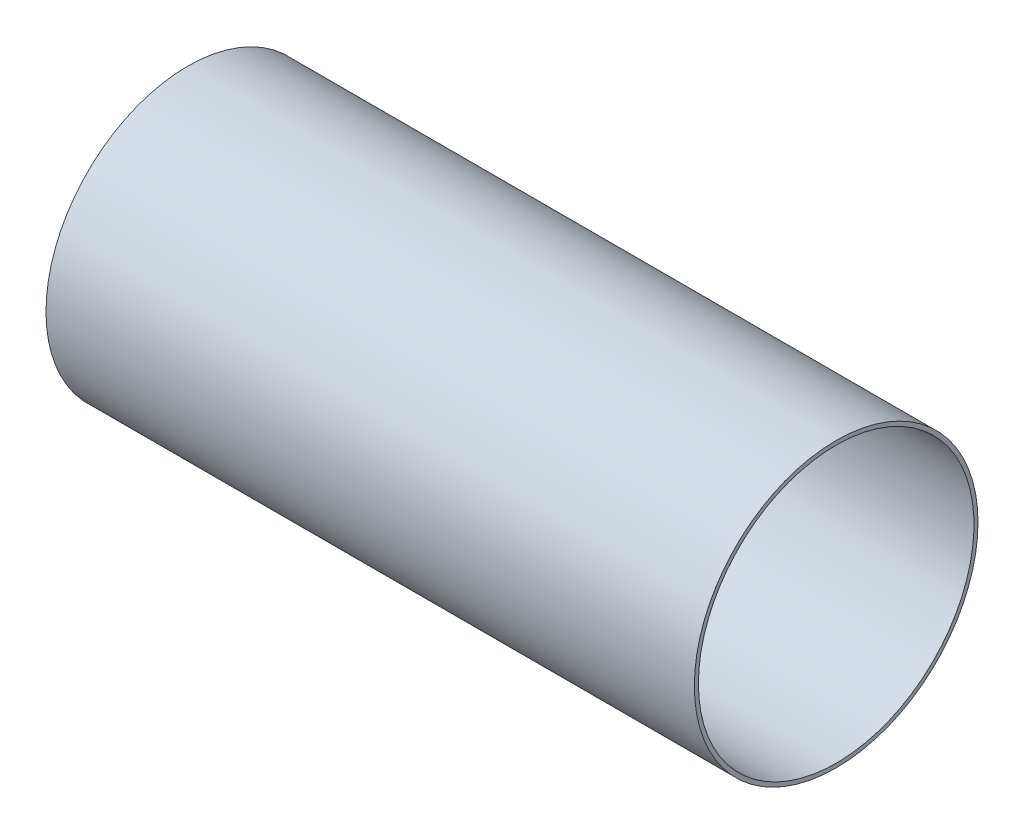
ISO-10303-21;
HEADER;
FILE_DESCRIPTION(('STEP AP214'),'2;1');
FILE_NAME('part.step','',(''),(''),'','','');
FILE_SCHEMA(('AUTOMOTIVE_DESIGN { 1 0 10303 214 1 1 1 1 }'));
ENDSEC;
DATA;
#1=APPLICATION_CONTEXT('core data for automotive mechanical design processes');
#2=APPLICATION_PROTOCOL_DEFINITION('international standard','automotive_design',2000,#1);
#3=PRODUCT_CONTEXT('',#1,'mechanical');
#4=PRODUCT('Part','Part','',(#3));
#5=PRODUCT_RELATED_PRODUCT_CATEGORY('part','',(#4));
#6=PRODUCT_DEFINITION_FORMATION('','',#4);
#7=PRODUCT_DEFINITION_CONTEXT('part definition',#1,'design');
#8=PRODUCT_DEFINITION('design','',#6,#7);
#9=PRODUCT_DEFINITION_SHAPE('','',#8);
#10=(LENGTH_UNIT() NAMED_UNIT(*) SI_UNIT(.MILLI.,.METRE.));
#11=(NAMED_UNIT(*) PLANE_ANGLE_UNIT() SI_UNIT($,.RADIAN.));
#12=(NAMED_UNIT(*) SI_UNIT($,.STERADIAN.) SOLID_ANGLE_UNIT());
#13=UNCERTAINTY_MEASURE_WITH_UNIT(LENGTH_MEASURE(1.E-05),#10,'distance_accuracy_value','');
#14=(GEOMETRIC_REPRESENTATION_CONTEXT(3) GLOBAL_UNCERTAINTY_ASSIGNED_CONTEXT((#13)) GLOBAL_UNIT_ASSIGNED_CONTEXT((#10,
#11,#12)) REPRESENTATION_CONTEXT('',''));
#15=CARTESIAN_POINT('',(0.,0.,0.));
#16=DIRECTION('',(0.,0.,1.));
#17=DIRECTION('',(1.,0.,0.));
#18=AXIS2_PLACEMENT_3D('',#15,#16,#17);
#19=CARTESIAN_POINT('',(0.,0.,0.));
#20=DIRECTION('',(-1.,0.,0.));
#21=DIRECTION('',(0.,0.,1.));
#22=AXIS2_PLACEMENT_3D('',#19,#20,#21);
#23=CYLINDRICAL_SURFACE('',#22,0.8);
#24=CARTESIAN_POINT('',(0.8,0.,0.));
#25=DIRECTION('',(-1.,0.,0.));
#26=DIRECTION('',(0.,0.,1.));
#27=AXIS2_PLACEMENT_3D('',#24,#25,#26);
#28=CIRCLE('',#27,0.8);
#29=CARTESIAN_POINT('',(0.8,0.,0.8));
#30=VERTEX_POINT('',#29);
#31=EDGE_CURVE('E57',#30,#30,#28,.T.);
#32=ORIENTED_EDGE('',*,*,#31,.F.);
#33=EDGE_LOOP('',(#32));
#34=FACE_BOUND('',#33,.T.);
#35=CARTESIAN_POINT('',(0.,0.,0.));
#36=DIRECTION('',(-1.,0.,0.));
#37=DIRECTION('',(0.,0.,1.));
#38=AXIS2_PLACEMENT_3D('',#35,#36,#37);
#39=CIRCLE('',#38,0.8);
#40=CARTESIAN_POINT('',(0.,0.,0.8));
#41=VERTEX_POINT('',#40);
#42=EDGE_CURVE('E10',#41,#41,#39,.T.);
#43=ORIENTED_EDGE('',*,*,#42,.T.);
#44=EDGE_LOOP('',(#43));
#45=FACE_BOUND('',#44,.T.);
#46=ADVANCED_FACE('F29',(#34,#45),#23,.F.);
#47=CARTESIAN_POINT('',(0.,3.5,0.));
#48=DIRECTION('',(1.,0.,0.));
#49=DIRECTION('',(0.,0.,-1.));
#50=AXIS2_PLACEMENT_3D('',#47,#48,#49);
#51=PLANE('',#50);
#52=ORIENTED_EDGE('',*,*,#42,.F.);
#53=EDGE_LOOP('',(#52));
#54=FACE_BOUND('',#53,.T.);
#55=CARTESIAN_POINT('',(0.,0.,0.));
#56=DIRECTION('',(-1.,0.,0.));
#57=DIRECTION('',(0.,0.,1.));
#58=AXIS2_PLACEMENT_3D('',#55,#56,#57);
#59=CIRCLE('',#58,3.5);
#60=CARTESIAN_POINT('',(0.,0.,3.5));
#61=VERTEX_POINT('',#60);
#62=EDGE_CURVE('E35',#61,#61,#59,.T.);
#63=ORIENTED_EDGE('',*,*,#62,.T.);
#64=EDGE_LOOP('',(#63));
#65=FACE_BOUND('',#64,.T.);
#66=ADVANCED_FACE('F65',(#54,#65),#51,.F.);
#67=CARTESIAN_POINT('',(0.,0.,0.));
#68=DIRECTION('',(-1.,0.,0.));
#69=DIRECTION('',(0.,0.,1.));
#70=AXIS2_PLACEMENT_3D('',#67,#68,#69);
#71=CYLINDRICAL_SURFACE('',#70,3.5);
#72=ORIENTED_EDGE('',*,*,#62,.F.);
#73=EDGE_LOOP('',(#72));
#74=FACE_BOUND('',#73,.T.);
#75=CARTESIAN_POINT('',(16.,0.,0.));
#76=DIRECTION('',(-1.,0.,0.));
#77=DIRECTION('',(0.,0.,1.));
#78=AXIS2_PLACEMENT_3D('',#75,#76,#77);
#79=CIRCLE('',#78,3.5);
#80=CARTESIAN_POINT('',(16.,0.,3.5));
#81=VERTEX_POINT('',#80);
#82=EDGE_CURVE('E39',#81,#81,#79,.T.);
#83=ORIENTED_EDGE('',*,*,#82,.T.);
#84=EDGE_LOOP('',(#83));
#85=FACE_BOUND('',#84,.T.);
#86=ADVANCED_FACE('F69',(#74,#85),#71,.T.);
#87=CARTESIAN_POINT('',(16.,3.5,0.));
#88=DIRECTION('',(1.,0.,0.));
#89=DIRECTION('',(0.,0.,-1.));
#90=AXIS2_PLACEMENT_3D('',#87,#88,#89);
#91=PLANE('',#90);
#92=CARTESIAN_POINT('',(16.,0.,0.));
#93=DIRECTION('',(-1.,0.,0.));
#94=DIRECTION('',(0.,0.,1.));
#95=AXIS2_PLACEMENT_3D('',#92,#93,#94);
#96=CIRCLE('',#95,3.4);
#97=CARTESIAN_POINT('',(16.,0.,3.4));
#98=VERTEX_POINT('',#97);
#99=EDGE_CURVE('E43',#98,#98,#96,.T.);
#100=ORIENTED_EDGE('',*,*,#99,.T.);
#101=EDGE_LOOP('',(#100));
#102=FACE_BOUND('',#101,.T.);
#103=ORIENTED_EDGE('',*,*,#82,.F.);
#104=EDGE_LOOP('',(#103));
#105=FACE_BOUND('',#104,.T.);
#106=ADVANCED_FACE('F74',(#102,#105),#91,.T.);
#107=CARTESIAN_POINT('',(0.,0.,0.));
#108=DIRECTION('',(-1.,0.,0.));
#109=DIRECTION('',(0.,0.,1.));
#110=AXIS2_PLACEMENT_3D('',#107,#108,#109);
#111=CYLINDRICAL_SURFACE('',#110,3.4);
#112=CARTESIAN_POINT('',(0.100000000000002,0.,0.));
#113=DIRECTION('',(-1.,0.,0.));
#114=DIRECTION('',(0.,0.,1.));
#115=AXIS2_PLACEMENT_3D('',#112,#113,#114);
#116=CIRCLE('',#115,3.4);
#117=CARTESIAN_POINT('',(0.100000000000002,0.,3.4));
#118=VERTEX_POINT('',#117);
#119=EDGE_CURVE('E48',#118,#118,#116,.T.);
#120=ORIENTED_EDGE('',*,*,#119,.T.);
#121=EDGE_LOOP('',(#120));
#122=FACE_BOUND('',#121,.T.);
#123=ORIENTED_EDGE('',*,*,#99,.F.);
#124=EDGE_LOOP('',(#123));
#125=FACE_BOUND('',#124,.T.);
#126=ADVANCED_FACE('F80',(#122,#125),#111,.F.);
#127=CARTESIAN_POINT('',(0.100000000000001,3.5,0.));
#128=DIRECTION('',(1.,0.,0.));
#129=DIRECTION('',(0.,0.,-1.));
#130=AXIS2_PLACEMENT_3D('',#127,#128,#129);
#131=PLANE('',#130);
#132=CARTESIAN_POINT('',(0.1,0.,0.));
#133=DIRECTION('',(-1.,0.,0.));
#134=DIRECTION('',(0.,0.,1.));
#135=AXIS2_PLACEMENT_3D('',#132,#133,#134);
#136=CIRCLE('',#135,0.9);
#137=CARTESIAN_POINT('',(0.1,0.,0.9));
#138=VERTEX_POINT('',#137);
#139=EDGE_CURVE('E51',#138,#138,#136,.T.);
#140=ORIENTED_EDGE('',*,*,#139,.T.);
#141=EDGE_LOOP('',(#140));
#142=FACE_BOUND('',#141,.T.);
#143=ORIENTED_EDGE('',*,*,#119,.F.);
#144=EDGE_LOOP('',(#143));
#145=FACE_BOUND('',#144,.T.);
#146=ADVANCED_FACE('F84',(#142,#145),#131,.T.);
#147=CARTESIAN_POINT('',(0.,0.,0.));
#148=DIRECTION('',(-1.,0.,0.));
#149=DIRECTION('',(0.,0.,1.));
#150=AXIS2_PLACEMENT_3D('',#147,#148,#149);
#151=CYLINDRICAL_SURFACE('',#150,0.9);
#152=CARTESIAN_POINT('',(0.8,0.,0.));
#153=DIRECTION('',(-1.,0.,0.));
#154=DIRECTION('',(0.,0.,1.));
#155=AXIS2_PLACEMENT_3D('',#152,#153,#154);
#156=CIRCLE('',#155,0.9);
#157=CARTESIAN_POINT('',(0.8,0.,0.9));
#158=VERTEX_POINT('',#157);
#159=EDGE_CURVE('E54',#158,#158,#156,.T.);
#160=ORIENTED_EDGE('',*,*,#159,.T.);
#161=EDGE_LOOP('',(#160));
#162=FACE_BOUND('',#161,.T.);
#163=ORIENTED_EDGE('',*,*,#139,.F.);
#164=EDGE_LOOP('',(#163));
#165=FACE_BOUND('',#164,.T.);
#166=ADVANCED_FACE('F88',(#162,#165),#151,.T.);
#167=CARTESIAN_POINT('',(0.8,0.9,0.));
#168=DIRECTION('',(1.,0.,0.));
#169=DIRECTION('',(0.,0.,-1.));
#170=AXIS2_PLACEMENT_3D('',#167,#168,#169);
#171=PLANE('',#170);
#172=ORIENTED_EDGE('',*,*,#31,.T.);
#173=EDGE_LOOP('',(#172));
#174=FACE_BOUND('',#173,.T.);
#175=ORIENTED_EDGE('',*,*,#159,.F.);
#176=EDGE_LOOP('',(#175));
#177=FACE_BOUND('',#176,.T.);
#178=ADVANCED_FACE('F61',(#174,#177),#171,.T.);
#179=CLOSED_SHELL('',(#46,#66,#86,#106,#126,#146,#166,#178));
#180=MANIFOLD_SOLID_BREP('B2',#179);
#181=ADVANCED_BREP_SHAPE_REPRESENTATION('',(#18,#180),#14);
#182=SHAPE_DEFINITION_REPRESENTATION(#9,#181);
ENDSEC;
END-ISO-10303-21;
